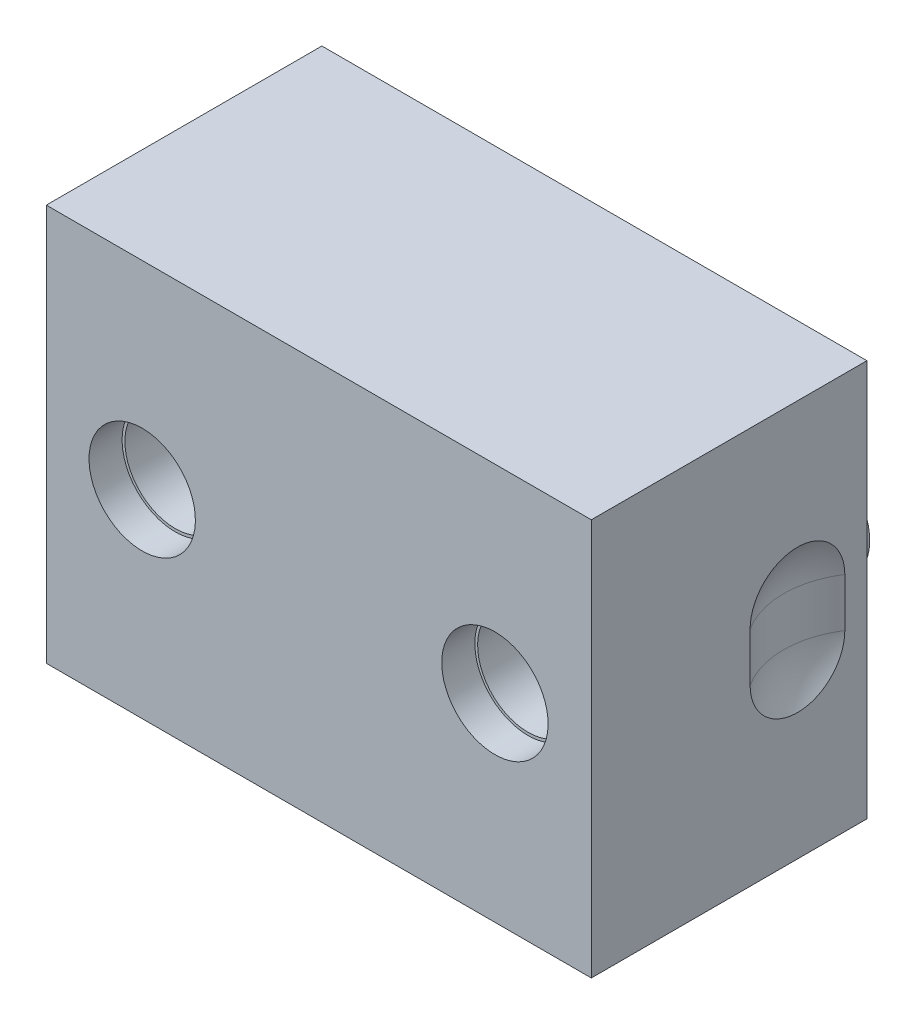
ISO-10303-21;
HEADER;
FILE_DESCRIPTION(('STEP AP214'),'2;1');
FILE_NAME('part.step','',(''),(''),'','','');
FILE_SCHEMA(('AUTOMOTIVE_DESIGN { 1 0 10303 214 1 1 1 1 }'));
ENDSEC;
DATA;
#1=APPLICATION_CONTEXT('core data for automotive mechanical design processes');
#2=APPLICATION_PROTOCOL_DEFINITION('international standard','automotive_design',2000,#1);
#3=PRODUCT_CONTEXT('',#1,'mechanical');
#4=PRODUCT('Part','Part','',(#3));
#5=PRODUCT_RELATED_PRODUCT_CATEGORY('part','',(#4));
#6=PRODUCT_DEFINITION_FORMATION('','',#4);
#7=PRODUCT_DEFINITION_CONTEXT('part definition',#1,'design');
#8=PRODUCT_DEFINITION('design','',#6,#7);
#9=PRODUCT_DEFINITION_SHAPE('','',#8);
#10=(LENGTH_UNIT() NAMED_UNIT(*) SI_UNIT(.MILLI.,.METRE.));
#11=(NAMED_UNIT(*) PLANE_ANGLE_UNIT() SI_UNIT($,.RADIAN.));
#12=(NAMED_UNIT(*) SI_UNIT($,.STERADIAN.) SOLID_ANGLE_UNIT());
#13=UNCERTAINTY_MEASURE_WITH_UNIT(LENGTH_MEASURE(1.E-05),#10,'distance_accuracy_value','');
#14=(GEOMETRIC_REPRESENTATION_CONTEXT(3) GLOBAL_UNCERTAINTY_ASSIGNED_CONTEXT((#13)) GLOBAL_UNIT_ASSIGNED_CONTEXT((#10,
#11,#12)) REPRESENTATION_CONTEXT('',''));
#15=CARTESIAN_POINT('',(0.,0.,0.));
#16=DIRECTION('',(0.,0.,1.));
#17=DIRECTION('',(1.,0.,0.));
#18=AXIS2_PLACEMENT_3D('',#15,#16,#17);
#19=CARTESIAN_POINT('',(31.9999999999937,6.98303303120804E-12,7.));
#20=DIRECTION('',(0.,0.,-1.));
#21=DIRECTION('',(0.,1.,0.));
#22=AXIS2_PLACEMENT_3D('',#19,#20,#21);
#23=CYLINDRICAL_SURFACE('',#22,2.6);
#24=CARTESIAN_POINT('',(31.9999999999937,6.98308201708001E-12,6.59999999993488));
#25=DIRECTION('',(0.,0.,1.));
#26=DIRECTION('',(0.,-1.,0.));
#27=AXIS2_PLACEMENT_3D('',#24,#25,#26);
#28=CIRCLE('',#27,2.59999999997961);
#29=CARTESIAN_POINT('',(31.9999999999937,-2.59999999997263,6.59999999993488));
#30=VERTEX_POINT('',#29);
#31=EDGE_CURVE('E142',#30,#30,#28,.T.);
#32=ORIENTED_EDGE('',*,*,#31,.T.);
#33=EDGE_LOOP('',(#32));
#34=FACE_BOUND('',#33,.T.);
#35=CARTESIAN_POINT('',(31.9999999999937,6.98389028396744E-12,0.));
#36=DIRECTION('',(0.,0.,-1.));
#37=DIRECTION('',(0.,1.,0.));
#38=AXIS2_PLACEMENT_3D('',#35,#36,#37);
#39=CIRCLE('',#38,2.6);
#40=CARTESIAN_POINT('',(31.9999999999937,2.60000000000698,0.));
#41=VERTEX_POINT('',#40);
#42=EDGE_CURVE('E18',#41,#41,#39,.F.);
#43=ORIENTED_EDGE('',*,*,#42,.F.);
#44=EDGE_LOOP('',(#43));
#45=FACE_BOUND('',#44,.T.);
#46=ADVANCED_FACE('F14',(#34,#45),#23,.F.);
#47=CARTESIAN_POINT('',(-6.21902529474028E-12,5.54116962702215E-12,7.));
#48=DIRECTION('',(0.,0.,-1.));
#49=DIRECTION('',(0.,1.,0.));
#50=AXIS2_PLACEMENT_3D('',#47,#48,#49);
#51=CYLINDRICAL_SURFACE('',#50,2.6);
#52=CARTESIAN_POINT('',(-6.21902529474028E-12,5.54121861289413E-12,6.59999999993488));
#53=DIRECTION('',(0.,0.,1.));
#54=DIRECTION('',(0.,-1.,0.));
#55=AXIS2_PLACEMENT_3D('',#52,#53,#54);
#56=CIRCLE('',#55,2.59999999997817);
#57=CARTESIAN_POINT('',(-6.21918449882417E-12,-2.59999999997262,6.59999999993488));
#58=VERTEX_POINT('',#57);
#59=EDGE_CURVE('E145',#58,#58,#56,.T.);
#60=ORIENTED_EDGE('',*,*,#59,.T.);
#61=EDGE_LOOP('',(#60));
#62=FACE_BOUND('',#61,.T.);
#63=CARTESIAN_POINT('',(-6.21902529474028E-12,5.54202687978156E-12,0.));
#64=DIRECTION('',(0.,0.,-1.));
#65=DIRECTION('',(0.,1.,0.));
#66=AXIS2_PLACEMENT_3D('',#63,#64,#65);
#67=CIRCLE('',#66,2.6);
#68=CARTESIAN_POINT('',(-6.21902529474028E-12,2.60000000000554,0.));
#69=VERTEX_POINT('',#68);
#70=EDGE_CURVE('E246',#69,#69,#67,.F.);
#71=ORIENTED_EDGE('',*,*,#70,.F.);
#72=EDGE_LOOP('',(#71));
#73=FACE_BOUND('',#72,.T.);
#74=ADVANCED_FACE('F256',(#62,#73),#51,.F.);
#75=CARTESIAN_POINT('',(-6.21902529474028E-12,5.54114046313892E-12,6.99999999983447));
#76=DIRECTION('',(0.,0.,1.));
#77=DIRECTION('',(0.,-1.,0.));
#78=AXIS2_PLACEMENT_3D('',#75,#76,#77);
#79=CONICAL_SURFACE('',#78,2.9999999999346,0.785398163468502);
#80=CARTESIAN_POINT('',(-6.21902529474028E-12,5.5411404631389E-12,6.99999999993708));
#81=DIRECTION('',(0.,0.,1.));
#82=DIRECTION('',(0.,-1.,0.));
#83=AXIS2_PLACEMENT_3D('',#80,#81,#82);
#84=CIRCLE('',#83,3.0000000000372);
#85=CARTESIAN_POINT('',(-6.21902529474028E-12,-3.00000000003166,6.99999999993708));
#86=VERTEX_POINT('',#85);
#87=EDGE_CURVE('E244',#86,#86,#84,.T.);
#88=ORIENTED_EDGE('',*,*,#87,.T.);
#89=EDGE_LOOP('',(#88));
#90=FACE_BOUND('',#89,.T.);
#91=ORIENTED_EDGE('',*,*,#59,.F.);
#92=EDGE_LOOP('',(#91));
#93=FACE_BOUND('',#92,.T.);
#94=ADVANCED_FACE('F263',(#90,#93),#79,.F.);
#95=CARTESIAN_POINT('',(31.9999999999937,6.98312935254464E-12,6.99999999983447));
#96=DIRECTION('',(0.,0.,1.));
#97=DIRECTION('',(0.,-1.,0.));
#98=AXIS2_PLACEMENT_3D('',#95,#96,#97);
#99=CONICAL_SURFACE('',#98,2.99999999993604,0.785398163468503);
#100=CARTESIAN_POINT('',(31.9999999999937,6.98312935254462E-12,6.99999999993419));
#101=DIRECTION('',(0.,0.,1.));
#102=DIRECTION('',(0.,-1.,0.));
#103=AXIS2_PLACEMENT_3D('',#100,#101,#102);
#104=CIRCLE('',#103,3.00000000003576);
#105=CARTESIAN_POINT('',(31.9999999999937,-3.00000000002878,6.99999999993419));
#106=VERTEX_POINT('',#105);
#107=EDGE_CURVE('E241',#106,#106,#104,.T.);
#108=ORIENTED_EDGE('',*,*,#107,.T.);
#109=EDGE_LOOP('',(#108));
#110=FACE_BOUND('',#109,.T.);
#111=ORIENTED_EDGE('',*,*,#31,.F.);
#112=EDGE_LOOP('',(#111));
#113=FACE_BOUND('',#112,.T.);
#114=ADVANCED_FACE('F269',(#110,#113),#99,.F.);
#115=CARTESIAN_POINT('',(29.4,0.,0.));
#116=DIRECTION('',(0.,0.,-1.));
#117=DIRECTION('',(0.,1.,0.));
#118=AXIS2_PLACEMENT_3D('',#115,#116,#117);
#119=PLANE('',#118);
#120=CARTESIAN_POINT('',(32.,0.,0.));
#121=DIRECTION('',(0.,0.,-1.));
#122=DIRECTION('',(0.,1.,0.));
#123=AXIS2_PLACEMENT_3D('',#120,#121,#122);
#124=CIRCLE('',#123,5.);
#125=CARTESIAN_POINT('',(32.,5.00000000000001,0.));
#126=VERTEX_POINT('',#125);
#127=EDGE_CURVE('E238',#126,#126,#124,.F.);
#128=ORIENTED_EDGE('',*,*,#127,.F.);
#129=EDGE_LOOP('',(#128));
#130=FACE_BOUND('',#129,.T.);
#131=ORIENTED_EDGE('',*,*,#42,.T.);
#132=EDGE_LOOP('',(#131));
#133=FACE_BOUND('',#132,.T.);
#134=ADVANCED_FACE('F253',(#130,#133),#119,.T.);
#135=CARTESIAN_POINT('',(-2.6,0.,0.));
#136=DIRECTION('',(0.,0.,-1.));
#137=DIRECTION('',(0.,1.,0.));
#138=AXIS2_PLACEMENT_3D('',#135,#136,#137);
#139=PLANE('',#138);
#140=CARTESIAN_POINT('',(0.,0.,0.));
#141=DIRECTION('',(0.,0.,-1.));
#142=DIRECTION('',(0.,1.,0.));
#143=AXIS2_PLACEMENT_3D('',#140,#141,#142);
#144=CIRCLE('',#143,5.);
#145=CARTESIAN_POINT('',(0.,5.00000000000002,0.));
#146=VERTEX_POINT('',#145);
#147=EDGE_CURVE('E235',#146,#146,#144,.F.);
#148=ORIENTED_EDGE('',*,*,#147,.F.);
#149=EDGE_LOOP('',(#148));
#150=FACE_BOUND('',#149,.T.);
#151=ORIENTED_EDGE('',*,*,#70,.T.);
#152=EDGE_LOOP('',(#151));
#153=FACE_BOUND('',#152,.T.);
#154=ADVANCED_FACE('F276',(#150,#153),#139,.T.);
#155=CARTESIAN_POINT('',(-3.33066907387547E-12,2.65352394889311E-12,7.));
#156=DIRECTION('',(0.,0.,-1.));
#157=DIRECTION('',(0.,1.,0.));
#158=AXIS2_PLACEMENT_3D('',#155,#156,#157);
#159=PLANE('',#158);
#160=CARTESIAN_POINT('',(-3.33066907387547E-12,2.65352394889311E-12,7.));
#161=DIRECTION('',(0.,0.,1.));
#162=DIRECTION('',(0.,-1.,0.));
#163=AXIS2_PLACEMENT_3D('',#160,#161,#162);
#164=CIRCLE('',#163,4.57);
#165=CARTESIAN_POINT('',(-3.33066907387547E-12,-4.56999999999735,7.));
#166=VERTEX_POINT('',#165);
#167=EDGE_CURVE('E232',#166,#166,#164,.T.);
#168=ORIENTED_EDGE('',*,*,#167,.T.);
#169=EDGE_LOOP('',(#168));
#170=FACE_BOUND('',#169,.T.);
#171=ORIENTED_EDGE('',*,*,#87,.F.);
#172=EDGE_LOOP('',(#171));
#173=FACE_BOUND('',#172,.T.);
#174=ADVANCED_FACE('F280',(#170,#173),#159,.F.);
#175=CARTESIAN_POINT('',(31.9999999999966,2.65156451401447E-12,7.));
#176=DIRECTION('',(0.,0.,-1.));
#177=DIRECTION('',(0.,1.,0.));
#178=AXIS2_PLACEMENT_3D('',#175,#176,#177);
#179=PLANE('',#178);
#180=CARTESIAN_POINT('',(31.9999999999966,2.65156451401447E-12,7.));
#181=DIRECTION('',(0.,0.,1.));
#182=DIRECTION('',(0.,-1.,0.));
#183=AXIS2_PLACEMENT_3D('',#180,#181,#182);
#184=CIRCLE('',#183,4.57);
#185=CARTESIAN_POINT('',(31.9999999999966,-4.56999999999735,7.));
#186=VERTEX_POINT('',#185);
#187=EDGE_CURVE('E81',#186,#186,#184,.T.);
#188=ORIENTED_EDGE('',*,*,#187,.T.);
#189=EDGE_LOOP('',(#188));
#190=FACE_BOUND('',#189,.T.);
#191=ORIENTED_EDGE('',*,*,#107,.F.);
#192=EDGE_LOOP('',(#191));
#193=FACE_BOUND('',#192,.T.);
#194=ADVANCED_FACE('F284',(#190,#193),#179,.F.);
#195=CARTESIAN_POINT('',(32.,0.,4.));
#196=DIRECTION('',(0.,0.,-1.));
#197=DIRECTION('',(0.,1.,0.));
#198=AXIS2_PLACEMENT_3D('',#195,#196,#197);
#199=CYLINDRICAL_SURFACE('',#198,5.);
#200=CARTESIAN_POINT('',(32.,0.,4.00000000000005));
#201=DIRECTION('',(0.,0.,-1.));
#202=DIRECTION('',(0.,1.,0.));
#203=AXIS2_PLACEMENT_3D('',#200,#201,#202);
#204=CIRCLE('',#203,5.);
#205=CARTESIAN_POINT('',(32.,5.00000000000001,4.00000000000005));
#206=VERTEX_POINT('',#205);
#207=EDGE_CURVE('E221',#206,#206,#204,.F.);
#208=ORIENTED_EDGE('',*,*,#207,.F.);
#209=EDGE_LOOP('',(#208));
#210=FACE_BOUND('',#209,.T.);
#211=ORIENTED_EDGE('',*,*,#127,.T.);
#212=EDGE_LOOP('',(#211));
#213=FACE_BOUND('',#212,.T.);
#214=ADVANCED_FACE('F288',(#210,#213),#199,.T.);
#215=CARTESIAN_POINT('',(0.,0.,4.));
#216=DIRECTION('',(0.,0.,-1.));
#217=DIRECTION('',(0.,1.,0.));
#218=AXIS2_PLACEMENT_3D('',#215,#216,#217);
#219=CYLINDRICAL_SURFACE('',#218,5.);
#220=CARTESIAN_POINT('',(0.,0.,4.00000000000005));
#221=DIRECTION('',(0.,0.,-1.));
#222=DIRECTION('',(0.,1.,0.));
#223=AXIS2_PLACEMENT_3D('',#220,#221,#222);
#224=CIRCLE('',#223,5.);
#225=CARTESIAN_POINT('',(0.,5.00000000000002,4.00000000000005));
#226=VERTEX_POINT('',#225);
#227=EDGE_CURVE('E211',#226,#226,#224,.F.);
#228=ORIENTED_EDGE('',*,*,#227,.F.);
#229=EDGE_LOOP('',(#228));
#230=FACE_BOUND('',#229,.T.);
#231=ORIENTED_EDGE('',*,*,#147,.T.);
#232=EDGE_LOOP('',(#231));
#233=FACE_BOUND('',#232,.T.);
#234=ADVANCED_FACE('F292',(#230,#233),#219,.T.);
#235=CARTESIAN_POINT('',(-3.33066907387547E-12,2.65156451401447E-12,23.));
#236=DIRECTION('',(0.,0.,1.));
#237=DIRECTION('',(0.,-1.,0.));
#238=AXIS2_PLACEMENT_3D('',#235,#236,#237);
#239=CYLINDRICAL_SURFACE('',#238,4.57);
#240=ORIENTED_EDGE('',*,*,#167,.F.);
#241=EDGE_LOOP('',(#240));
#242=FACE_BOUND('',#241,.T.);
#243=CARTESIAN_POINT('',(-3.33066907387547E-12,2.65119712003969E-12,25.9999994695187));
#244=DIRECTION('',(0.,0.,1.));
#245=DIRECTION('',(0.,-1.,0.));
#246=AXIS2_PLACEMENT_3D('',#243,#244,#245);
#247=CIRCLE('',#246,4.57);
#248=CARTESIAN_POINT('',(-3.33066907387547E-12,-4.56999999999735,25.9999994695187));
#249=VERTEX_POINT('',#248);
#250=EDGE_CURVE('E208',#249,#249,#247,.T.);
#251=ORIENTED_EDGE('',*,*,#250,.T.);
#252=EDGE_LOOP('',(#251));
#253=FACE_BOUND('',#252,.T.);
#254=ADVANCED_FACE('F296',(#242,#253),#239,.F.);
#255=CARTESIAN_POINT('',(31.9999999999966,2.64960507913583E-12,23.));
#256=DIRECTION('',(0.,0.,1.));
#257=DIRECTION('',(0.,-1.,0.));
#258=AXIS2_PLACEMENT_3D('',#255,#256,#257);
#259=CYLINDRICAL_SURFACE('',#258,4.57);
#260=ORIENTED_EDGE('',*,*,#187,.F.);
#261=EDGE_LOOP('',(#260));
#262=FACE_BOUND('',#261,.T.);
#263=CARTESIAN_POINT('',(31.9999999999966,2.64923768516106E-12,25.9999994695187));
#264=DIRECTION('',(0.,0.,1.));
#265=DIRECTION('',(0.,-1.,0.));
#266=AXIS2_PLACEMENT_3D('',#263,#264,#265);
#267=CIRCLE('',#266,4.57);
#268=CARTESIAN_POINT('',(31.9999999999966,-4.56999999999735,25.9999994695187));
#269=VERTEX_POINT('',#268);
#270=EDGE_CURVE('E96',#269,#269,#267,.T.);
#271=ORIENTED_EDGE('',*,*,#270,.T.);
#272=EDGE_LOOP('',(#271));
#273=FACE_BOUND('',#272,.T.);
#274=ADVANCED_FACE('F300',(#262,#273),#259,.F.);
#275=CARTESIAN_POINT('',(-15.33,-2.20429583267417,10.2999993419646));
#276=DIRECTION('',(0.423558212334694,0.712417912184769,0.559516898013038));
#277=DIRECTION('',(-0.905680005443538,0.320424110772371,0.277618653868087));
#278=AXIS2_PLACEMENT_3D('',#275,#276,#277);
#279=SPHERICAL_SURFACE('',#278,7.9);
#280=CARTESIAN_POINT('',(-15.33,-2.20429583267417,10.2999993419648));
#281=DIRECTION('',(0.,-1.,0.));
#282=DIRECTION('',(0.,0.,-1.));
#283=AXIS2_PLACEMENT_3D('',#280,#281,#282);
#284=CIRCLE('',#283,7.9);
#285=CARTESIAN_POINT('',(-8.7,-2.20429583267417,14.5957065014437));
#286=VERTEX_POINT('',#285);
#287=CARTESIAN_POINT('',(-8.7,-2.20429583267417,6.0042921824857));
#288=VERTEX_POINT('',#287);
#289=EDGE_CURVE('E73',#286,#288,#284,.F.);
#290=ORIENTED_EDGE('',*,*,#289,.T.);
#291=CARTESIAN_POINT('',(-8.7,-2.20429583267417,6.00429218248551));
#292=CARTESIAN_POINT('',(-8.7,-2.32511395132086,6.00427919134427));
#293=CARTESIAN_POINT('',(-8.7,-2.44593020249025,6.00938870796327));
#294=CARTESIAN_POINT('',(-8.7,-2.68669834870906,6.02975893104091));
#295=CARTESIAN_POINT('',(-8.7,-2.80665028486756,6.04501915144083));
#296=CARTESIAN_POINT('',(-8.7,-3.04475719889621,6.08558271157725));
#297=CARTESIAN_POINT('',(-8.7,-3.16291338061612,6.11087898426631));
#298=CARTESIAN_POINT('',(-8.7,-3.39667451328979,6.17133061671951));
#299=CARTESIAN_POINT('',(-8.7,-3.51227949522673,6.20648585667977));
#300=CARTESIAN_POINT('',(-8.7,-3.74015097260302,6.2864183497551));
#301=CARTESIAN_POINT('',(-8.7,-3.8524165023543,6.33119835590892));
#302=CARTESIAN_POINT('',(-8.7,-4.07281728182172,6.43007414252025));
#303=CARTESIAN_POINT('',(-8.7,-4.18095099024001,6.48417335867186));
#304=CARTESIAN_POINT('',(-8.7,-4.39221521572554,6.60125821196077));
#305=CARTESIAN_POINT('',(-8.7,-4.49534852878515,6.66423880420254));
#306=CARTESIAN_POINT('',(-8.7,-4.69598170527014,6.79868682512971));
#307=CARTESIAN_POINT('',(-8.7,-4.79347947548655,6.87015737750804));
#308=CARTESIAN_POINT('',(-8.7,-4.98207424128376,7.02103229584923));
#309=CARTESIAN_POINT('',(-8.69999999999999,-5.07317344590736,7.10043390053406));
#310=CARTESIAN_POINT('',(-8.70000000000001,-5.24839335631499,7.26665815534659));
#311=CARTESIAN_POINT('',(-8.70000000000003,-5.3325114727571,7.35348353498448));
#312=CARTESIAN_POINT('',(-8.69999999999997,-5.49311603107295,7.53389306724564));
#313=CARTESIAN_POINT('',(-8.69999999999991,-5.56960412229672,7.62747575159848));
#314=CARTESIAN_POINT('',(-8.70000000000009,-5.71445248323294,7.82078712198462));
#315=CARTESIAN_POINT('',(-8.70000000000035,-5.78280974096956,7.92051806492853));
#316=CARTESIAN_POINT('',(-8.70000000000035,-5.91085088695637,8.12534291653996));
#317=CARTESIAN_POINT('',(-8.70000000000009,-5.97053834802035,8.23043459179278));
#318=CARTESIAN_POINT('',(-8.69999999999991,-6.08086973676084,8.44531165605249));
#319=CARTESIAN_POINT('',(-8.7,-6.13151031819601,8.55509876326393));
#320=CARTESIAN_POINT('',(-8.7,-6.22334078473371,8.7785011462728));
#321=CARTESIAN_POINT('',(-8.69999999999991,-6.26453474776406,8.89211474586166));
#322=CARTESIAN_POINT('',(-8.70000000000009,-6.33722068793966,9.122450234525));
#323=CARTESIAN_POINT('',(-8.70000000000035,-6.36870908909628,9.2391732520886));
#324=CARTESIAN_POINT('',(-8.70000000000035,-6.42173046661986,9.47481749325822));
#325=CARTESIAN_POINT('',(-8.70000000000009,-6.4432667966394,9.59373796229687));
#326=CARTESIAN_POINT('',(-8.69999999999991,-6.47625238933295,9.83301192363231));
#327=CARTESIAN_POINT('',(-8.69999999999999,-6.48769814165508,9.95336589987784));
#328=CARTESIAN_POINT('',(-8.70000000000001,-6.50040744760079,10.1945920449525));
#329=CARTESIAN_POINT('',(-8.69999999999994,-6.50167253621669,10.3154641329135));
#330=CARTESIAN_POINT('',(-8.70000000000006,-6.49401556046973,10.5568852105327));
#331=CARTESIAN_POINT('',(-8.70000000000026,-6.48509349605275,10.6774342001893));
#332=CARTESIAN_POINT('',(-8.70000000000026,-6.45712333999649,10.9173717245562));
#333=CARTESIAN_POINT('',(-8.70000000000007,-6.43807358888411,11.036760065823));
#334=CARTESIAN_POINT('',(-8.69999999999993,-6.38999089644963,11.2734659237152));
#335=CARTESIAN_POINT('',(-8.69999999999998,-6.36096142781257,11.3907841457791));
#336=CARTESIAN_POINT('',(-8.70000000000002,-6.29311212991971,11.6225997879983));
#337=CARTESIAN_POINT('',(-8.7,-6.25428883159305,11.7370961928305));
#338=CARTESIAN_POINT('',(-8.69999999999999,-6.16714916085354,11.9623691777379));
#339=CARTESIAN_POINT('',(-8.7,-6.11883628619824,12.0731471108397));
#340=CARTESIAN_POINT('',(-8.7,-6.01303082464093,12.2902830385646));
#341=CARTESIAN_POINT('',(-8.7,-5.95553462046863,12.3966392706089));
#342=CARTESIAN_POINT('',(-8.7,-5.83180799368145,12.6040905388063));
#343=CARTESIAN_POINT('',(-8.7,-5.76558080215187,12.7051875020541));
#344=CARTESIAN_POINT('',(-8.7,-5.62482392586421,12.9014753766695));
#345=CARTESIAN_POINT('',(-8.7,-5.55029159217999,12.9966643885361));
#346=CARTESIAN_POINT('',(-8.7,-5.39350072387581,13.1803901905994));
#347=CARTESIAN_POINT('',(-8.7,-5.31124505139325,13.2689294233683));
#348=CARTESIAN_POINT('',(-8.7,-5.13954860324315,13.4387852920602));
#349=CARTESIAN_POINT('',(-8.7,-5.05010614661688,13.5201002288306));
#350=CARTESIAN_POINT('',(-8.7,-4.86472313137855,13.6748774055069));
#351=CARTESIAN_POINT('',(-8.7,-4.76878498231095,13.7483425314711));
#352=CARTESIAN_POINT('',(-8.7,-4.57099465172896,13.8869802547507));
#353=CARTESIAN_POINT('',(-8.7,-4.46913844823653,13.9521471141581));
#354=CARTESIAN_POINT('',(-8.7,-4.26033524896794,14.0736430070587));
#355=CARTESIAN_POINT('',(-8.7,-4.15339014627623,14.12997529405));
#356=CARTESIAN_POINT('',(-8.7,-3.93502758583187,14.2334813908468));
#357=CARTESIAN_POINT('',(-8.7,-3.8236058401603,14.2806461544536));
#358=CARTESIAN_POINT('',(-8.7,-3.59722389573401,14.3653963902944));
#359=CARTESIAN_POINT('',(-8.7,-3.48226504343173,14.4029854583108));
#360=CARTESIAN_POINT('',(-8.7,-3.24971945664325,14.468303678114));
#361=CARTESIAN_POINT('',(-8.7,-3.13213575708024,14.496043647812));
#362=CARTESIAN_POINT('',(-8.7,-2.89509682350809,14.5415140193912));
#363=CARTESIAN_POINT('',(-8.7,-2.77564253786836,14.5592493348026));
#364=CARTESIAN_POINT('',(-8.7,-2.58065620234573,14.5798529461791));
#365=CARTESIAN_POINT('',(-8.7,-2.50543627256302,14.5858018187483));
#366=CARTESIAN_POINT('',(-8.7,-2.35491211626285,14.5937257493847));
#367=CARTESIAN_POINT('',(-8.7,-2.27960823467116,14.5957073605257));
#368=CARTESIAN_POINT('',(-8.7,-2.20429583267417,14.5957065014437));
#369=B_SPLINE_CURVE_WITH_KNOTS('',3,(#291,#292,#293,#294,#295,#296,#297,#298,#299,#300,#301,
#302,#303,#304,#305,#306,#307,#308,#309,#310,#311,#312,#313,#314,#315,#316,#317,#318,#319,#320,
#321,#322,#323,#324,#325,#326,#327,#328,#329,#330,#331,#332,#333,#334,#335,#336,#337,#338,#339,
#340,#341,#342,#343,#344,#345,#346,#347,#348,#349,#350,#351,#352,#353,#354,#355,#356,#357,#358,
#359,#360,#361,#362,#363,#364,#365,#366,#367,#368),.UNSPECIFIED.,.F.,.F.,(4,2,2,2,2,2,2,2,2,2,2,
2,2,2,2,2,2,2,2,2,2,2,2,2,2,2,2,2,2,2,2,2,2,2,2,2,2,2,4),(0.,0.362343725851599,
0.724670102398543,1.08674179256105,1.44880908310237,1.81098007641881,2.17328487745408,
2.53538470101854,2.89761816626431,3.25972595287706,3.62196745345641,3.9841304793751,
4.34642724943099,4.70857429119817,5.07085500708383,5.43297903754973,5.79523633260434,
6.15737146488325,6.51963252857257,6.88183897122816,7.2440454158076,7.60631122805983,
7.96845110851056,8.33071944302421,8.6928544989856,9.05513255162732,9.41727691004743,
9.7795371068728,10.1416635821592,10.5038750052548,10.8659527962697,11.228279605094,
11.590472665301,11.9530213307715,12.3154336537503,12.6774466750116,13.039281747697,
13.2655500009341,13.4914441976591),.UNSPECIFIED.);
#370=EDGE_CURVE('E79',#288,#286,#369,.T.);
#371=ORIENTED_EDGE('',*,*,#370,.T.);
#372=EDGE_LOOP('',(#290,#371));
#373=FACE_BOUND('',#372,.T.);
#374=ADVANCED_FACE('F78',(#373),#279,.F.);
#375=CARTESIAN_POINT('',(-15.33,-26.004661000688,10.2999993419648));
#376=DIRECTION('',(0.,-1.,0.));
#377=DIRECTION('',(0.,0.,-1.));
#378=AXIS2_PLACEMENT_3D('',#375,#376,#377);
#379=CYLINDRICAL_SURFACE('',#378,7.9);
#380=DIRECTION('',(0.,1.,0.));
#381=VECTOR('',#380,1.);
#382=CARTESIAN_POINT('',(-8.7,1.00135803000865E-06,14.5957065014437));
#383=LINE('',#382,#381);
#384=CARTESIAN_POINT('',(-8.7,2.20428984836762,14.5957065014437));
#385=VERTEX_POINT('',#384);
#386=EDGE_CURVE('E89',#286,#385,#383,.T.);
#387=ORIENTED_EDGE('',*,*,#386,.T.);
#388=CARTESIAN_POINT('',(-15.33,2.20428984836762,10.2999993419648));
#389=DIRECTION('',(0.,-1.,0.));
#390=DIRECTION('',(0.,0.,-1.));
#391=AXIS2_PLACEMENT_3D('',#388,#389,#390);
#392=CIRCLE('',#391,7.9);
#393=CARTESIAN_POINT('',(-8.7,2.20428984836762,6.0042921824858));
#394=VERTEX_POINT('',#393);
#395=EDGE_CURVE('E80',#385,#394,#392,.F.);
#396=ORIENTED_EDGE('',*,*,#395,.T.);
#397=DIRECTION('',(0.,1.,0.));
#398=VECTOR('',#397,1.);
#399=CARTESIAN_POINT('',(-8.7,1.00135803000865E-06,6.00429218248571));
#400=LINE('',#399,#398);
#401=EDGE_CURVE('E87',#394,#288,#400,.F.);
#402=ORIENTED_EDGE('',*,*,#401,.T.);
#403=ORIENTED_EDGE('',*,*,#289,.F.);
#404=EDGE_LOOP('',(#387,#396,#402,#403));
#405=FACE_BOUND('',#404,.T.);
#406=ADVANCED_FACE('F91',(#405),#379,.F.);
#407=CARTESIAN_POINT('',(-15.33,2.20428984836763,10.2999993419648));
#408=DIRECTION('',(0.423558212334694,0.712417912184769,0.559516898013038));
#409=DIRECTION('',(-0.905680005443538,0.320424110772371,0.277618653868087));
#410=AXIS2_PLACEMENT_3D('',#407,#408,#409);
#411=SPHERICAL_SURFACE('',#410,7.9);
#412=ORIENTED_EDGE('',*,*,#395,.F.);
#413=CARTESIAN_POINT('',(-8.7,2.20428984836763,14.5957065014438));
#414=CARTESIAN_POINT('',(-8.7,2.32510796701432,14.5957194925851));
#415=CARTESIAN_POINT('',(-8.7,2.4459242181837,14.5906099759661));
#416=CARTESIAN_POINT('',(-8.7,2.68669236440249,14.5702397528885));
#417=CARTESIAN_POINT('',(-8.7,2.80664430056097,14.5549795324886));
#418=CARTESIAN_POINT('',(-8.7,3.04475121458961,14.5144159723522));
#419=CARTESIAN_POINT('',(-8.7,3.16290739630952,14.4891196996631));
#420=CARTESIAN_POINT('',(-8.7,3.39666852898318,14.4286680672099));
#421=CARTESIAN_POINT('',(-8.7,3.5122735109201,14.3935128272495));
#422=CARTESIAN_POINT('',(-8.7,3.7401449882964,14.3135803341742));
#423=CARTESIAN_POINT('',(-8.7,3.85241051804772,14.2688003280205));
#424=CARTESIAN_POINT('',(-8.7,4.07281129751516,14.1699245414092));
#425=CARTESIAN_POINT('',(-8.7,4.18094500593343,14.1158253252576));
#426=CARTESIAN_POINT('',(-8.7,4.39220923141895,13.9987404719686));
#427=CARTESIAN_POINT('',(-8.7,4.49534254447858,13.9357598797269));
#428=CARTESIAN_POINT('',(-8.7,4.69597572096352,13.8013118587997));
#429=CARTESIAN_POINT('',(-8.7,4.79347349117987,13.7298413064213));
#430=CARTESIAN_POINT('',(-8.7,4.9820682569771,13.5789663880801));
#431=CARTESIAN_POINT('',(-8.7,5.07316746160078,13.4995647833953));
#432=CARTESIAN_POINT('',(-8.7,5.24838737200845,13.3333405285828));
#433=CARTESIAN_POINT('',(-8.7,5.33250548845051,13.2465151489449));
#434=CARTESIAN_POINT('',(-8.7,5.49311004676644,13.0661056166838));
#435=CARTESIAN_POINT('',(-8.7,5.56959813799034,12.972522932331));
#436=CARTESIAN_POINT('',(-8.7,5.71444649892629,12.7792115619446));
#437=CARTESIAN_POINT('',(-8.7,5.78280375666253,12.6794806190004));
#438=CARTESIAN_POINT('',(-8.7,5.91084490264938,12.4746557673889));
#439=CARTESIAN_POINT('',(-8.7,5.97053236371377,12.3695640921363));
#440=CARTESIAN_POINT('',(-8.7,6.08086375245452,12.1546870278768));
#441=CARTESIAN_POINT('',(-8.7,6.13150433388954,12.0448999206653));
#442=CARTESIAN_POINT('',(-8.7,6.22333480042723,11.8214975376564));
#443=CARTESIAN_POINT('',(-8.7,6.26452876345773,11.7078839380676));
#444=CARTESIAN_POINT('',(-8.7,6.337214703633,11.4775484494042));
#445=CARTESIAN_POINT('',(-8.7,6.36870310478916,11.3608254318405));
#446=CARTESIAN_POINT('',(-8.7,6.42172448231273,11.1251811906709));
#447=CARTESIAN_POINT('',(-8.7,6.44326081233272,11.0062607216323));
#448=CARTESIAN_POINT('',(-8.7,6.47624640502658,10.766986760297));
#449=CARTESIAN_POINT('',(-8.7,6.48769215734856,10.6466327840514));
#450=CARTESIAN_POINT('',(-8.7,6.50040146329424,10.4054066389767));
#451=CARTESIAN_POINT('',(-8.7,6.50166655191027,10.2845345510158));
#452=CARTESIAN_POINT('',(-8.7,6.49400957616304,10.0431134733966));
#453=CARTESIAN_POINT('',(-8.7,6.48508751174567,9.92256448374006));
#454=CARTESIAN_POINT('',(-8.7,6.45711735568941,9.6826269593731));
#455=CARTESIAN_POINT('',(-8.7,6.43806760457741,9.56323861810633));
#456=CARTESIAN_POINT('',(-8.7,6.3899849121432,9.32653276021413));
#457=CARTESIAN_POINT('',(-8.7,6.36095544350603,9.20921453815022));
#458=CARTESIAN_POINT('',(-8.7,6.29310614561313,8.97739889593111));
#459=CARTESIAN_POINT('',(-8.7,6.25428284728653,8.86290249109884));
#460=CARTESIAN_POINT('',(-8.7,6.16714317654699,8.63762950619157));
#461=CARTESIAN_POINT('',(-8.7,6.1188303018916,8.52685157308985));
#462=CARTESIAN_POINT('',(-8.7,6.01302484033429,8.30971564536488));
#463=CARTESIAN_POINT('',(-8.7,5.95552863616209,8.20335941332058));
#464=CARTESIAN_POINT('',(-8.7,5.83180200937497,7.99590814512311));
#465=CARTESIAN_POINT('',(-8.7,5.76557481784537,7.89481118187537));
#466=CARTESIAN_POINT('',(-8.7,5.62481794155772,7.69852330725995));
#467=CARTESIAN_POINT('',(-8.7,5.55028560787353,7.6033342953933));
#468=CARTESIAN_POINT('',(-8.7,5.39349473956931,7.4196084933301));
#469=CARTESIAN_POINT('',(-8.7,5.31123906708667,7.33106926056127));
#470=CARTESIAN_POINT('',(-8.7,5.13954261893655,7.16121339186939));
#471=CARTESIAN_POINT('',(-8.7,5.05010016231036,7.07989845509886));
#472=CARTESIAN_POINT('',(-8.7,4.86471714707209,6.92512127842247));
#473=CARTESIAN_POINT('',(-8.7,4.76877899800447,6.85165615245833));
#474=CARTESIAN_POINT('',(-8.7,4.57098866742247,6.71301842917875));
#475=CARTESIAN_POINT('',(-8.7,4.46913246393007,6.64785156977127));
#476=CARTESIAN_POINT('',(-8.7,4.26032926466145,6.52635567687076));
#477=CARTESIAN_POINT('',(-8.7,4.15338416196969,6.4700233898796));
#478=CARTESIAN_POINT('',(-8.7,3.93502160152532,6.36651729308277));
#479=CARTESIAN_POINT('',(-8.7,3.8235998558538,6.31935252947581));
#480=CARTESIAN_POINT('',(-8.7,3.59721791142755,6.23460229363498));
#481=CARTESIAN_POINT('',(-8.7,3.48225905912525,6.19701322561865));
#482=CARTESIAN_POINT('',(-8.7,3.24971347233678,6.13169500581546));
#483=CARTESIAN_POINT('',(-8.7,3.13212977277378,6.10395503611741));
#484=CARTESIAN_POINT('',(-8.7,2.89509083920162,6.05848466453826));
#485=CARTESIAN_POINT('',(-8.7,2.77563655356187,6.04074934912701));
#486=CARTESIAN_POINT('',(-8.7,2.58065021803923,6.02014573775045));
#487=CARTESIAN_POINT('',(-8.7,2.50543028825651,6.01419686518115));
#488=CARTESIAN_POINT('',(-8.7,2.35490613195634,6.00627293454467));
#489=CARTESIAN_POINT('',(-8.7,2.27960225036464,6.00429132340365));
#490=CARTESIAN_POINT('',(-8.7,2.20428984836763,6.00429218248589));
#491=B_SPLINE_CURVE_WITH_KNOTS('',3,(#413,#414,#415,#416,#417,#418,#419,#420,#421,#422,#423,
#424,#425,#426,#427,#428,#429,#430,#431,#432,#433,#434,#435,#436,#437,#438,#439,#440,#441,#442,
#443,#444,#445,#446,#447,#448,#449,#450,#451,#452,#453,#454,#455,#456,#457,#458,#459,#460,#461,
#462,#463,#464,#465,#466,#467,#468,#469,#470,#471,#472,#473,#474,#475,#476,#477,#478,#479,#480,
#481,#482,#483,#484,#485,#486,#487,#488,#489,#490),.UNSPECIFIED.,.F.,.F.,(4,2,2,2,2,2,2,2,2,2,2,
2,2,2,2,2,2,2,2,2,2,2,2,2,2,2,2,2,2,2,2,2,2,2,2,2,2,2,4),(0.,0.362343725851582,
0.724670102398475,1.08674179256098,1.44880908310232,1.81098007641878,2.17328487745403,
2.53538470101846,2.89761816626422,3.25972595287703,3.62196745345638,3.98413047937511,
4.3464272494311,4.70857429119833,5.07085500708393,5.43297903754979,5.7952363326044,
6.15737146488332,6.51963252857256,6.88183897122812,7.24404541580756,7.60631122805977,
7.96845110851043,8.330719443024,8.69285449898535,9.05513255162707,9.41727691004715,
9.77953710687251,10.141663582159,10.5038750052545,10.8659527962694,11.2282796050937,
11.5904726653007,11.9530213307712,12.31543365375,12.6774466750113,13.0392817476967,
13.2655500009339,13.4914441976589),.UNSPECIFIED.);
#492=EDGE_CURVE('E108',#385,#394,#491,.T.);
#493=ORIENTED_EDGE('',*,*,#492,.T.);
#494=EDGE_LOOP('',(#412,#493));
#495=FACE_BOUND('',#494,.T.);
#496=ADVANCED_FACE('F314',(#495),#411,.F.);
#497=CARTESIAN_POINT('',(47.3750996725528,2.20429284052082,10.3));
#498=DIRECTION('',(0.423558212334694,0.712417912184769,0.559516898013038));
#499=DIRECTION('',(-0.905680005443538,0.320424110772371,0.277618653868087));
#500=AXIS2_PLACEMENT_3D('',#497,#498,#499);
#501=SPHERICAL_SURFACE('',#500,7.9);
#502=CARTESIAN_POINT('',(47.3750996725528,2.20429284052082,10.3));
#503=DIRECTION('',(0.,1.,0.));
#504=DIRECTION('',(0.,0.,1.));
#505=AXIS2_PLACEMENT_3D('',#502,#503,#504);
#506=CIRCLE('',#505,7.9);
#507=CARTESIAN_POINT('',(40.7450996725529,2.20429284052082,14.5957071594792));
#508=VERTEX_POINT('',#507);
#509=CARTESIAN_POINT('',(40.7450996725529,2.20429284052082,6.00429284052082));
#510=VERTEX_POINT('',#509);
#511=EDGE_CURVE('E227',#508,#510,#506,.F.);
#512=ORIENTED_EDGE('',*,*,#511,.T.);
#513=CARTESIAN_POINT('',(40.7450996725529,2.20429284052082,6.00429284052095));
#514=CARTESIAN_POINT('',(40.7450996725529,2.32511095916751,6.00427984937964));
#515=CARTESIAN_POINT('',(40.7450996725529,2.4459272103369,6.00938936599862));
#516=CARTESIAN_POINT('',(40.7450996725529,2.68669535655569,6.02975958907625));
#517=CARTESIAN_POINT('',(40.7450996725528,2.80664729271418,6.04501980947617));
#518=CARTESIAN_POINT('',(40.7450996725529,3.04475420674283,6.08558336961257));
#519=CARTESIAN_POINT('',(40.7450996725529,3.16291038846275,6.11087964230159));
#520=CARTESIAN_POINT('',(40.7450996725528,3.39667152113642,6.17133127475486));
#521=CARTESIAN_POINT('',(40.7450996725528,3.51227650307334,6.2064865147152));
#522=CARTESIAN_POINT('',(40.7450996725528,3.74014798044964,6.28641900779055));
#523=CARTESIAN_POINT('',(40.7450996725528,3.85241351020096,6.33119901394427));
#524=CARTESIAN_POINT('',(40.7450996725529,4.07281428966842,6.43007480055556));
#525=CARTESIAN_POINT('',(40.7450996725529,4.18094799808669,6.4841740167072));
#526=CARTESIAN_POINT('',(40.7450996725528,4.39221222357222,6.60125886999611));
#527=CARTESIAN_POINT('',(40.7450996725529,4.49534553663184,6.66423946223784));
#528=CARTESIAN_POINT('',(40.7450996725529,4.69597871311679,6.79868748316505));
#529=CARTESIAN_POINT('',(40.7450996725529,4.79347648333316,6.87015803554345));
#530=CARTESIAN_POINT('',(40.7450996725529,4.98207124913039,7.02103295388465));
#531=CARTESIAN_POINT('',(40.7450996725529,5.07317045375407,7.10043455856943));
#532=CARTESIAN_POINT('',(40.7450996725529,5.24839036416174,7.26665881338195));
#533=CARTESIAN_POINT('',(40.7450996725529,5.33250848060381,7.35348419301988));
#534=CARTESIAN_POINT('',(40.7450996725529,5.49311303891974,7.53389372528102));
#535=CARTESIAN_POINT('',(40.7450996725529,5.56960113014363,7.6274764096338));
#536=CARTESIAN_POINT('',(40.7450996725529,5.71444949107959,7.82078778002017));
#537=CARTESIAN_POINT('',(40.7450996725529,5.78280674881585,7.92051872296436));
#538=CARTESIAN_POINT('',(40.7450996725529,5.91084789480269,8.12534357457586));
#539=CARTESIAN_POINT('',(40.7450996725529,5.97053535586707,8.23043524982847));
#540=CARTESIAN_POINT('',(40.7450996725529,6.08086674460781,8.44531231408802));
#541=CARTESIAN_POINT('',(40.7450996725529,6.13150732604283,8.55509942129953));
#542=CARTESIAN_POINT('',(40.7450996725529,6.22333779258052,8.77850180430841));
#543=CARTESIAN_POINT('',(40.7450996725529,6.26453175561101,8.89211540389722));
#544=CARTESIAN_POINT('',(40.7450996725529,6.33721769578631,9.12245089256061));
#545=CARTESIAN_POINT('',(40.7450996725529,6.3687060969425,9.23917391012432));
#546=CARTESIAN_POINT('',(40.7450996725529,6.42172747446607,9.47481815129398));
#547=CARTESIAN_POINT('',(40.7450996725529,6.44326380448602,9.59373862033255));
#548=CARTESIAN_POINT('',(40.7450996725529,6.47624939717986,9.83301258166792));
#549=CARTESIAN_POINT('',(40.7450996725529,6.48769514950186,9.95336655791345));
#550=CARTESIAN_POINT('',(40.7450996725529,6.50040445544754,10.1945927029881));
#551=CARTESIAN_POINT('',(40.7450996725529,6.50166954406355,10.3154647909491));
#552=CARTESIAN_POINT('',(40.7450996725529,6.49401256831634,10.5568858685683));
#553=CARTESIAN_POINT('',(40.7450996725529,6.48509050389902,10.6774348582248));
#554=CARTESIAN_POINT('',(40.7450996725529,6.45712034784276,10.9173723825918));
#555=CARTESIAN_POINT('',(40.7450996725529,6.4380705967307,11.0367607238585));
#556=CARTESIAN_POINT('',(40.7450996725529,6.38998790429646,11.2734665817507));
#557=CARTESIAN_POINT('',(40.7450996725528,6.36095843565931,11.3907848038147));
#558=CARTESIAN_POINT('',(40.7450996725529,6.2931091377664,11.6226004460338));
#559=CARTESIAN_POINT('',(40.7450996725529,6.25428583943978,11.737096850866));
#560=CARTESIAN_POINT('',(40.7450996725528,6.16714616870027,11.9623698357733));
#561=CARTESIAN_POINT('',(40.7450996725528,6.11883329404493,12.0731477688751));
#562=CARTESIAN_POINT('',(40.7450996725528,6.01302783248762,12.2902836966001));
#563=CARTESIAN_POINT('',(40.7450996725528,5.95553162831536,12.3966399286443));
#564=CARTESIAN_POINT('',(40.7450996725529,5.83180500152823,12.6040911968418));
#565=CARTESIAN_POINT('',(40.7450996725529,5.76557780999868,12.7051881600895));
#566=CARTESIAN_POINT('',(40.7450996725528,5.62482093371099,12.9014760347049));
#567=CARTESIAN_POINT('',(40.7450996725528,5.5502886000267,12.9966650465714));
#568=CARTESIAN_POINT('',(40.7450996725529,5.39349773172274,13.1803908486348));
#569=CARTESIAN_POINT('',(40.7450996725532,5.31124205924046,13.268930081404));
#570=CARTESIAN_POINT('',(40.7450996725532,5.1395456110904,13.4387859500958));
#571=CARTESIAN_POINT('',(40.7450996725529,5.0501031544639,13.520100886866));
#572=CARTESIAN_POINT('',(40.7450996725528,4.86472013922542,13.6748780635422));
#573=CARTESIAN_POINT('',(40.7450996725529,4.7687819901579,13.7483431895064));
#574=CARTESIAN_POINT('',(40.7450996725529,4.57099165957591,13.886980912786));
#575=CARTESIAN_POINT('',(40.7450996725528,4.46913545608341,13.9521477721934));
#576=CARTESIAN_POINT('',(40.7450996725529,4.26033225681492,14.0736436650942));
#577=CARTESIAN_POINT('',(40.7450996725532,4.15338715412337,14.1299759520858));
#578=CARTESIAN_POINT('',(40.7450996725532,3.93502459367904,14.2334820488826));
#579=CARTESIAN_POINT('',(40.7450996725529,3.82360284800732,14.2806468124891));
#580=CARTESIAN_POINT('',(40.7450996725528,3.59722090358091,14.3653970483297));
#581=CARTESIAN_POINT('',(40.7450996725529,3.48226205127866,14.4029861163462));
#582=CARTESIAN_POINT('',(40.7450996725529,3.24971646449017,14.4683043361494));
#583=CARTESIAN_POINT('',(40.7450996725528,3.13213276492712,14.4960443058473));
#584=CARTESIAN_POINT('',(40.7450996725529,2.89509383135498,14.5415146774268));
#585=CARTESIAN_POINT('',(40.7450996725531,2.7756395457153,14.5592499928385));
#586=CARTESIAN_POINT('',(40.7450996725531,2.58065321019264,14.5798536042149));
#587=CARTESIAN_POINT('',(40.7450996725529,2.50543328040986,14.5858024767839));
#588=CARTESIAN_POINT('',(40.7450996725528,2.35490912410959,14.5937264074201));
#589=CARTESIAN_POINT('',(40.7450996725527,2.27960524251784,14.595708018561));
#590=CARTESIAN_POINT('',(40.7450996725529,2.20429284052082,14.5957071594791));
#591=B_SPLINE_CURVE_WITH_KNOTS('',3,(#513,#514,#515,#516,#517,#518,#519,#520,#521,#522,#523,
#524,#525,#526,#527,#528,#529,#530,#531,#532,#533,#534,#535,#536,#537,#538,#539,#540,#541,#542,
#543,#544,#545,#546,#547,#548,#549,#550,#551,#552,#553,#554,#555,#556,#557,#558,#559,#560,#561,
#562,#563,#564,#565,#566,#567,#568,#569,#570,#571,#572,#573,#574,#575,#576,#577,#578,#579,#580,
#581,#582,#583,#584,#585,#586,#587,#588,#589,#590),.UNSPECIFIED.,.F.,.F.,(4,2,2,2,2,2,2,2,2,2,2,
2,2,2,2,2,2,2,2,2,2,2,2,2,2,2,2,2,2,2,2,2,2,2,2,2,2,2,4),(0.,0.362343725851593,
0.724670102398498,1.08674179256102,1.44880908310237,1.81098007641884,2.1732848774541,
2.53538470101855,2.89761816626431,3.25972595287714,3.62196745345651,3.98413047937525,
4.34642724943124,4.70857429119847,5.07085500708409,5.43297903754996,5.79523633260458,
6.15737146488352,6.51963252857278,6.88183897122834,7.24404541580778,7.60631122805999,
7.96845110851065,8.33071944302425,8.69285449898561,9.05513255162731,9.41727691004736,
9.77953710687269,10.1416635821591,10.5038750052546,10.8659527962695,11.2282796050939,
11.5904726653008,11.9530213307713,12.3154336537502,12.6774466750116,13.039281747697,
13.2655500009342,13.4914441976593),.UNSPECIFIED.);
#592=EDGE_CURVE('E113',#510,#508,#591,.T.);
#593=ORIENTED_EDGE('',*,*,#592,.T.);
#594=EDGE_LOOP('',(#512,#593));
#595=FACE_BOUND('',#594,.T.);
#596=ADVANCED_FACE('F317',(#595),#501,.F.);
#597=CARTESIAN_POINT('',(47.3750996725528,-26.0046580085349,10.3));
#598=DIRECTION('',(0.,1.,0.));
#599=DIRECTION('',(0.,0.,1.));
#600=AXIS2_PLACEMENT_3D('',#597,#598,#599);
#601=CYLINDRICAL_SURFACE('',#600,7.9);
#602=DIRECTION('',(0.,-1.,0.));
#603=VECTOR('',#602,1.);
#604=CARTESIAN_POINT('',(40.7450996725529,0.,6.00429284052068));
#605=LINE('',#604,#603);
#606=CARTESIAN_POINT('',(40.7450996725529,-2.20429284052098,6.00429284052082));
#607=VERTEX_POINT('',#606);
#608=EDGE_CURVE('E114',#607,#510,#605,.F.);
#609=ORIENTED_EDGE('',*,*,#608,.T.);
#610=ORIENTED_EDGE('',*,*,#511,.F.);
#611=DIRECTION('',(0.,-1.,0.));
#612=VECTOR('',#611,1.);
#613=CARTESIAN_POINT('',(40.7450996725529,0.,14.5957071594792));
#614=LINE('',#613,#612);
#615=CARTESIAN_POINT('',(40.7450996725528,-2.20429284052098,14.5957071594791));
#616=VERTEX_POINT('',#615);
#617=EDGE_CURVE('E109',#508,#616,#614,.T.);
#618=ORIENTED_EDGE('',*,*,#617,.T.);
#619=CARTESIAN_POINT('',(47.3750996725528,-2.20429284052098,10.3));
#620=DIRECTION('',(0.,1.,0.));
#621=DIRECTION('',(0.,0.,1.));
#622=AXIS2_PLACEMENT_3D('',#619,#620,#621);
#623=CIRCLE('',#622,7.9);
#624=EDGE_CURVE('E224',#616,#607,#623,.F.);
#625=ORIENTED_EDGE('',*,*,#624,.T.);
#626=EDGE_LOOP('',(#609,#610,#618,#625));
#627=FACE_BOUND('',#626,.T.);
#628=ADVANCED_FACE('F337',(#627),#601,.F.);
#629=CARTESIAN_POINT('',(47.3750996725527,-2.20429284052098,10.2999999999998));
#630=DIRECTION('',(0.423558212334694,0.712417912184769,0.559516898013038));
#631=DIRECTION('',(-0.905680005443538,0.320424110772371,0.277618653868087));
#632=AXIS2_PLACEMENT_3D('',#629,#630,#631);
#633=SPHERICAL_SURFACE('',#632,7.9);
#634=ORIENTED_EDGE('',*,*,#624,.F.);
#635=CARTESIAN_POINT('',(40.7450996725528,-2.20429284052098,14.595707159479));
#636=CARTESIAN_POINT('',(40.7450996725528,-2.32511095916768,14.5957201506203));
#637=CARTESIAN_POINT('',(40.7450996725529,-2.44592721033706,14.5906106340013));
#638=CARTESIAN_POINT('',(40.7450996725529,-2.68669535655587,14.5702404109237));
#639=CARTESIAN_POINT('',(40.7450996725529,-2.80664729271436,14.5549801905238));
#640=CARTESIAN_POINT('',(40.7450996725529,-3.04475420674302,14.5144166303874));
#641=CARTESIAN_POINT('',(40.7450996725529,-3.16291038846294,14.4891203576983));
#642=CARTESIAN_POINT('',(40.7450996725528,-3.39667152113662,14.4286687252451));
#643=CARTESIAN_POINT('',(40.7450996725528,-3.51227650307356,14.3935134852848));
#644=CARTESIAN_POINT('',(40.7450996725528,-3.74014798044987,14.3135809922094));
#645=CARTESIAN_POINT('',(40.7450996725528,-3.85241351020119,14.2688009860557));
#646=CARTESIAN_POINT('',(40.7450996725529,-4.07281428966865,14.1699251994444));
#647=CARTESIAN_POINT('',(40.7450996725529,-4.18094799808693,14.1158259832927));
#648=CARTESIAN_POINT('',(40.7450996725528,-4.39221222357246,13.9987411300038));
#649=CARTESIAN_POINT('',(40.7450996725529,-4.49534553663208,13.9357605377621));
#650=CARTESIAN_POINT('',(40.7450996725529,-4.69597871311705,13.8013125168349));
#651=CARTESIAN_POINT('',(40.7450996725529,-4.79347648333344,13.7298419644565));
#652=CARTESIAN_POINT('',(40.7450996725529,-4.98207124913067,13.5789670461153));
#653=CARTESIAN_POINT('',(40.7450996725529,-5.07317045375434,13.4995654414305));
#654=CARTESIAN_POINT('',(40.7450996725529,-5.24839036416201,13.3333411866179));
#655=CARTESIAN_POINT('',(40.7450996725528,-5.33250848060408,13.24651580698));
#656=CARTESIAN_POINT('',(40.7450996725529,-5.49311303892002,13.0661062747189));
#657=CARTESIAN_POINT('',(40.7450996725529,-5.5696011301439,12.9725235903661));
#658=CARTESIAN_POINT('',(40.7450996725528,-5.71444949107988,12.7792122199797));
#659=CARTESIAN_POINT('',(40.7450996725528,-5.78280674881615,12.6794812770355));
#660=CARTESIAN_POINT('',(40.7450996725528,-5.910847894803,12.474656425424));
#661=CARTESIAN_POINT('',(40.7450996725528,-5.97053535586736,12.3695647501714));
#662=CARTESIAN_POINT('',(40.7450996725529,-6.08086674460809,12.1546876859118));
#663=CARTESIAN_POINT('',(40.7450996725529,-6.13150732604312,12.0449005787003));
#664=CARTESIAN_POINT('',(40.7450996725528,-6.22333779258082,11.8214981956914));
#665=CARTESIAN_POINT('',(40.7450996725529,-6.26453175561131,11.7078845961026));
#666=CARTESIAN_POINT('',(40.7450996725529,-6.33721769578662,11.4775491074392));
#667=CARTESIAN_POINT('',(40.7450996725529,-6.36870609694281,11.3608260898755));
#668=CARTESIAN_POINT('',(40.7450996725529,-6.42172747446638,11.1251818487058));
#669=CARTESIAN_POINT('',(40.7450996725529,-6.44326380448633,11.0062613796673));
#670=CARTESIAN_POINT('',(40.7450996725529,-6.47624939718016,10.7669874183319));
#671=CARTESIAN_POINT('',(40.7450996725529,-6.48769514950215,10.6466334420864));
#672=CARTESIAN_POINT('',(40.7450996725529,-6.50040445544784,10.4054072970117));
#673=CARTESIAN_POINT('',(40.7450996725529,-6.50166954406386,10.2845352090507));
#674=CARTESIAN_POINT('',(40.7450996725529,-6.49401256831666,10.0431141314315));
#675=CARTESIAN_POINT('',(40.7450996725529,-6.48509050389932,9.92256514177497));
#676=CARTESIAN_POINT('',(40.7450996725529,-6.45712034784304,9.682627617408));
#677=CARTESIAN_POINT('',(40.7450996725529,-6.438070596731,9.56323927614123));
#678=CARTESIAN_POINT('',(40.7450996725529,-6.38998790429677,9.32653341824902));
#679=CARTESIAN_POINT('',(40.7450996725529,-6.36095843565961,9.2092151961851));
#680=CARTESIAN_POINT('',(40.7450996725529,-6.29310913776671,8.97739955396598));
#681=CARTESIAN_POINT('',(40.7450996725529,-6.25428583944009,8.86290314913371));
#682=CARTESIAN_POINT('',(40.7450996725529,-6.16714616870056,8.63763016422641));
#683=CARTESIAN_POINT('',(40.7450996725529,-6.1188332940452,8.52685223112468));
#684=CARTESIAN_POINT('',(40.7450996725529,-6.01302783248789,8.30971630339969));
#685=CARTESIAN_POINT('',(40.7450996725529,-5.95553162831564,8.20336007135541));
#686=CARTESIAN_POINT('',(40.7450996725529,-5.83180500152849,7.99590880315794));
#687=CARTESIAN_POINT('',(40.7450996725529,-5.7655778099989,7.89481183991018));
#688=CARTESIAN_POINT('',(40.7450996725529,-5.62482093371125,7.69852396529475));
#689=CARTESIAN_POINT('',(40.7450996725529,-5.55028860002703,7.60333495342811));
#690=CARTESIAN_POINT('',(40.7450996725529,-5.39349773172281,7.41960915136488));
#691=CARTESIAN_POINT('',(40.7450996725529,-5.3112420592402,7.33106991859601));
#692=CARTESIAN_POINT('',(40.7450996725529,-5.13954561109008,7.16121404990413));
#693=CARTESIAN_POINT('',(40.7450996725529,-5.05010315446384,7.07989911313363));
#694=CARTESIAN_POINT('',(40.7450996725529,-4.86472013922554,6.92512193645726));
#695=CARTESIAN_POINT('',(40.7450996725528,-4.76878199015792,6.8516568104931));
#696=CARTESIAN_POINT('',(40.7450996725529,-4.57099165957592,6.7130190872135));
#697=CARTESIAN_POINT('',(40.7450996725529,-4.4691354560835,6.64785222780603));
#698=CARTESIAN_POINT('',(40.7450996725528,-4.26033225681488,6.5263563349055));
#699=CARTESIAN_POINT('',(40.7450996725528,-4.15338715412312,6.4700240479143));
#700=CARTESIAN_POINT('',(40.7450996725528,-3.93502459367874,6.36651795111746));
#701=CARTESIAN_POINT('',(40.7450996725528,-3.8236028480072,6.31935318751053));
#702=CARTESIAN_POINT('',(40.7450996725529,-3.59722090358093,6.23460295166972));
#703=CARTESIAN_POINT('',(40.7450996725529,-3.48226205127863,6.19701388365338));
#704=CARTESIAN_POINT('',(40.7450996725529,-3.24971646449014,6.13169566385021));
#705=CARTESIAN_POINT('',(40.7450996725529,-3.13213276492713,6.10395569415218));
#706=CARTESIAN_POINT('',(40.7450996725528,-2.89509383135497,6.05848532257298));
#707=CARTESIAN_POINT('',(40.7450996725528,-2.77563954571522,6.04075000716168));
#708=CARTESIAN_POINT('',(40.7450996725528,-2.58065321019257,6.02014639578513));
#709=CARTESIAN_POINT('',(40.7450996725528,-2.50543328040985,6.01419752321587));
#710=CARTESIAN_POINT('',(40.7450996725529,-2.35490912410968,6.00627359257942));
#711=CARTESIAN_POINT('',(40.7450996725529,-2.27960524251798,6.00429198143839));
#712=CARTESIAN_POINT('',(40.7450996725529,-2.20429284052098,6.00429284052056));
#713=B_SPLINE_CURVE_WITH_KNOTS('',3,(#635,#636,#637,#638,#639,#640,#641,#642,#643,#644,#645,
#646,#647,#648,#649,#650,#651,#652,#653,#654,#655,#656,#657,#658,#659,#660,#661,#662,#663,#664,
#665,#666,#667,#668,#669,#670,#671,#672,#673,#674,#675,#676,#677,#678,#679,#680,#681,#682,#683,
#684,#685,#686,#687,#688,#689,#690,#691,#692,#693,#694,#695,#696,#697,#698,#699,#700,#701,#702,
#703,#704,#705,#706,#707,#708,#709,#710,#711,#712),.UNSPECIFIED.,.F.,.F.,(4,2,2,2,2,2,2,2,2,2,2,
2,2,2,2,2,2,2,2,2,2,2,2,2,2,2,2,2,2,2,2,2,2,2,2,2,2,2,4),(0.,0.362343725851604,
0.724670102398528,1.08674179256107,1.44880908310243,1.81098007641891,2.17328487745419,
2.53538470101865,2.89761816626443,3.25972595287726,3.62196745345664,3.98413047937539,
4.34642724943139,4.70857429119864,5.07085500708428,5.43297903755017,5.7952363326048,
6.15737146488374,6.519632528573,6.88183897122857,7.24404541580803,7.60631122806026,
7.96845110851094,8.33071944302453,8.69285449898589,9.05513255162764,9.41727691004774,
9.77953710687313,10.1416635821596,10.5038750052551,10.8659527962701,11.2282796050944,
11.5904726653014,11.9530213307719,12.3154336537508,12.6774466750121,13.0392817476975,
13.2655500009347,13.4914441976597),.UNSPECIFIED.);
#714=EDGE_CURVE('E112',#616,#607,#713,.T.);
#715=ORIENTED_EDGE('',*,*,#714,.T.);
#716=EDGE_LOOP('',(#634,#715));
#717=FACE_BOUND('',#716,.T.);
#718=ADVANCED_FACE('F168',(#717),#633,.F.);
#719=CARTESIAN_POINT('',(16.,0.,4.00000000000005));
#720=DIRECTION('',(0.,0.,-1.));
#721=DIRECTION('',(0.,1.,0.));
#722=AXIS2_PLACEMENT_3D('',#719,#720,#721);
#723=PLANE('',#722);
#724=DIRECTION('',(1.,0.,0.));
#725=VECTOR('',#724,1.);
#726=CARTESIAN_POINT('',(16.,-18.,4.00000000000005));
#727=LINE('',#726,#725);
#728=CARTESIAN_POINT('',(40.7450996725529,-18.,4.00000000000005));
#729=VERTEX_POINT('',#728);
#730=CARTESIAN_POINT('',(-8.7,-17.999999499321,4.00000000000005));
#731=VERTEX_POINT('',#730);
#732=EDGE_CURVE('E122',#729,#731,#727,.F.);
#733=ORIENTED_EDGE('',*,*,#732,.T.);
#734=DIRECTION('',(0.,1.,0.));
#735=VECTOR('',#734,1.);
#736=CARTESIAN_POINT('',(-8.7,1.00135803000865E-06,4.00000000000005));
#737=LINE('',#736,#735);
#738=CARTESIAN_POINT('',(-8.7,18.0000007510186,4.00000000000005));
#739=VERTEX_POINT('',#738);
#740=EDGE_CURVE('E93',#731,#739,#737,.T.);
#741=ORIENTED_EDGE('',*,*,#740,.T.);
#742=DIRECTION('',(1.,0.,0.));
#743=VECTOR('',#742,1.);
#744=CARTESIAN_POINT('',(16.,18.,4.00000000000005));
#745=LINE('',#744,#743);
#746=CARTESIAN_POINT('',(40.7450996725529,18.0000002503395,4.00000000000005));
#747=VERTEX_POINT('',#746);
#748=EDGE_CURVE('E101',#739,#747,#745,.T.);
#749=ORIENTED_EDGE('',*,*,#748,.T.);
#750=DIRECTION('',(0.,-1.,0.));
#751=VECTOR('',#750,1.);
#752=CARTESIAN_POINT('',(40.7450996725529,0.,4.00000000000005));
#753=LINE('',#752,#751);
#754=EDGE_CURVE('E117',#747,#729,#753,.T.);
#755=ORIENTED_EDGE('',*,*,#754,.T.);
#756=EDGE_LOOP('',(#733,#741,#749,#755));
#757=FACE_BOUND('',#756,.T.);
#758=ORIENTED_EDGE('',*,*,#227,.T.);
#759=EDGE_LOOP('',(#758));
#760=FACE_BOUND('',#759,.T.);
#761=ORIENTED_EDGE('',*,*,#207,.T.);
#762=EDGE_LOOP('',(#761));
#763=FACE_BOUND('',#762,.T.);
#764=ADVANCED_FACE('F329',(#757,#760,#763),#723,.T.);
#765=CARTESIAN_POINT('',(-3.33066907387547E-12,2.65119712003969E-12,25.9999994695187));
#766=DIRECTION('',(0.,0.,-1.));
#767=DIRECTION('',(0.,1.,0.));
#768=AXIS2_PLACEMENT_3D('',#765,#766,#767);
#769=PLANE('',#768);
#770=CARTESIAN_POINT('',(-3.33066907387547E-12,2.65119712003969E-12,25.9999994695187));
#771=DIRECTION('',(0.,0.,-1.));
#772=DIRECTION('',(0.,1.,0.));
#773=AXIS2_PLACEMENT_3D('',#770,#771,#772);
#774=CIRCLE('',#773,4.825);
#775=CARTESIAN_POINT('',(-3.33066907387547E-12,4.82500000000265,25.9999994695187));
#776=VERTEX_POINT('',#775);
#777=EDGE_CURVE('E125',#776,#776,#774,.F.);
#778=ORIENTED_EDGE('',*,*,#777,.T.);
#779=EDGE_LOOP('',(#778));
#780=FACE_BOUND('',#779,.T.);
#781=ORIENTED_EDGE('',*,*,#250,.F.);
#782=EDGE_LOOP('',(#781));
#783=FACE_BOUND('',#782,.T.);
#784=ADVANCED_FACE('F203',(#780,#783),#769,.F.);
#785=CARTESIAN_POINT('',(31.9999999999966,2.64923768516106E-12,25.9999994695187));
#786=DIRECTION('',(0.,0.,-1.));
#787=DIRECTION('',(0.,1.,0.));
#788=AXIS2_PLACEMENT_3D('',#785,#786,#787);
#789=PLANE('',#788);
#790=CARTESIAN_POINT('',(31.9999999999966,2.64923768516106E-12,25.9999994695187));
#791=DIRECTION('',(0.,0.,-1.));
#792=DIRECTION('',(0.,1.,0.));
#793=AXIS2_PLACEMENT_3D('',#790,#791,#792);
#794=CIRCLE('',#793,4.825);
#795=CARTESIAN_POINT('',(31.9999999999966,4.82500000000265,25.9999994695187));
#796=VERTEX_POINT('',#795);
#797=EDGE_CURVE('E141',#796,#796,#794,.F.);
#798=ORIENTED_EDGE('',*,*,#797,.T.);
#799=EDGE_LOOP('',(#798));
#800=FACE_BOUND('',#799,.T.);
#801=ORIENTED_EDGE('',*,*,#270,.F.);
#802=EDGE_LOOP('',(#801));
#803=FACE_BOUND('',#802,.T.);
#804=ADVANCED_FACE('F200',(#800,#803),#789,.F.);
#805=CARTESIAN_POINT('',(-8.7,1.00135803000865E-06,21.5));
#806=DIRECTION('',(1.,0.,0.));
#807=DIRECTION('',(0.,1.,0.));
#808=AXIS2_PLACEMENT_3D('',#805,#806,#807);
#809=PLANE('',#808);
#810=ORIENTED_EDGE('',*,*,#386,.F.);
#811=ORIENTED_EDGE('',*,*,#370,.F.);
#812=ORIENTED_EDGE('',*,*,#401,.F.);
#813=ORIENTED_EDGE('',*,*,#492,.F.);
#814=EDGE_LOOP('',(#810,#811,#812,#813));
#815=FACE_BOUND('',#814,.T.);
#816=DIRECTION('',(0.,0.,1.));
#817=VECTOR('',#816,1.);
#818=CARTESIAN_POINT('',(-8.7,-18.,21.5));
#819=LINE('',#818,#817);
#820=CARTESIAN_POINT('',(-8.7,-17.999999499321,28.9999994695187));
#821=VERTEX_POINT('',#820);
#822=EDGE_CURVE('E127',#731,#821,#819,.T.);
#823=ORIENTED_EDGE('',*,*,#822,.T.);
#824=DIRECTION('',(0.,1.,0.));
#825=VECTOR('',#824,1.);
#826=CARTESIAN_POINT('',(-8.7,0.,28.9999994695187));
#827=LINE('',#826,#825);
#828=CARTESIAN_POINT('',(-8.7,18.0000007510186,28.9999994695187));
#829=VERTEX_POINT('',#828);
#830=EDGE_CURVE('E138',#821,#829,#827,.T.);
#831=ORIENTED_EDGE('',*,*,#830,.T.);
#832=DIRECTION('',(0.,0.,-1.));
#833=VECTOR('',#832,1.);
#834=CARTESIAN_POINT('',(-8.7,18.,21.5));
#835=LINE('',#834,#833);
#836=EDGE_CURVE('E105',#829,#739,#835,.T.);
#837=ORIENTED_EDGE('',*,*,#836,.T.);
#838=ORIENTED_EDGE('',*,*,#740,.F.);
#839=EDGE_LOOP('',(#823,#831,#837,#838));
#840=FACE_BOUND('',#839,.T.);
#841=ADVANCED_FACE('F84',(#815,#840),#809,.F.);
#842=CARTESIAN_POINT('',(16.,18.,21.5));
#843=DIRECTION('',(0.,-1.,0.));
#844=DIRECTION('',(0.,0.,-1.));
#845=AXIS2_PLACEMENT_3D('',#842,#843,#844);
#846=PLANE('',#845);
#847=DIRECTION('',(0.,0.,1.));
#848=VECTOR('',#847,1.);
#849=CARTESIAN_POINT('',(40.7450996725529,18.,21.5));
#850=LINE('',#849,#848);
#851=CARTESIAN_POINT('',(40.7450996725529,18.0000002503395,28.9999994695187));
#852=VERTEX_POINT('',#851);
#853=EDGE_CURVE('E104',#852,#747,#850,.F.);
#854=ORIENTED_EDGE('',*,*,#853,.T.);
#855=ORIENTED_EDGE('',*,*,#748,.F.);
#856=ORIENTED_EDGE('',*,*,#836,.F.);
#857=DIRECTION('',(1.,0.,0.));
#858=VECTOR('',#857,1.);
#859=CARTESIAN_POINT('',(16.,18.0000010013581,28.9999994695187));
#860=LINE('',#859,#858);
#861=EDGE_CURVE('E135',#829,#852,#860,.T.);
#862=ORIENTED_EDGE('',*,*,#861,.T.);
#863=EDGE_LOOP('',(#854,#855,#856,#862));
#864=FACE_BOUND('',#863,.T.);
#865=ADVANCED_FACE('F178',(#864),#846,.F.);
#866=CARTESIAN_POINT('',(40.7450996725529,0.,21.5));
#867=DIRECTION('',(-1.,0.,0.));
#868=DIRECTION('',(0.,-1.,0.));
#869=AXIS2_PLACEMENT_3D('',#866,#867,#868);
#870=PLANE('',#869);
#871=ORIENTED_EDGE('',*,*,#617,.F.);
#872=ORIENTED_EDGE('',*,*,#592,.F.);
#873=ORIENTED_EDGE('',*,*,#608,.F.);
#874=ORIENTED_EDGE('',*,*,#714,.F.);
#875=EDGE_LOOP('',(#871,#872,#873,#874));
#876=FACE_BOUND('',#875,.T.);
#877=ORIENTED_EDGE('',*,*,#853,.F.);
#878=DIRECTION('',(0.,1.,0.));
#879=VECTOR('',#878,1.);
#880=CARTESIAN_POINT('',(40.7450996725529,0.,28.9999994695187));
#881=LINE('',#880,#879);
#882=CARTESIAN_POINT('',(40.7450996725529,-18.,28.9999994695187));
#883=VERTEX_POINT('',#882);
#884=EDGE_CURVE('E132',#852,#883,#881,.F.);
#885=ORIENTED_EDGE('',*,*,#884,.T.);
#886=DIRECTION('',(0.,0.,1.));
#887=VECTOR('',#886,1.);
#888=CARTESIAN_POINT('',(40.7450996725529,-18.,21.5));
#889=LINE('',#888,#887);
#890=EDGE_CURVE('E33',#883,#729,#889,.F.);
#891=ORIENTED_EDGE('',*,*,#890,.T.);
#892=ORIENTED_EDGE('',*,*,#754,.F.);
#893=EDGE_LOOP('',(#877,#885,#891,#892));
#894=FACE_BOUND('',#893,.T.);
#895=ADVANCED_FACE('F172',(#876,#894),#870,.F.);
#896=CARTESIAN_POINT('',(16.,-18.,21.5));
#897=DIRECTION('',(0.,1.,0.));
#898=DIRECTION('',(0.,0.,1.));
#899=AXIS2_PLACEMENT_3D('',#896,#897,#898);
#900=PLANE('',#899);
#901=ORIENTED_EDGE('',*,*,#890,.F.);
#902=DIRECTION('',(1.,0.,0.));
#903=VECTOR('',#902,1.);
#904=CARTESIAN_POINT('',(16.,-18.,28.9999994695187));
#905=LINE('',#904,#903);
#906=EDGE_CURVE('E130',#883,#821,#905,.F.);
#907=ORIENTED_EDGE('',*,*,#906,.T.);
#908=ORIENTED_EDGE('',*,*,#822,.F.);
#909=ORIENTED_EDGE('',*,*,#732,.F.);
#910=EDGE_LOOP('',(#901,#907,#908,#909));
#911=FACE_BOUND('',#910,.T.);
#912=ADVANCED_FACE('F177',(#911),#900,.F.);
#913=CARTESIAN_POINT('',(-3.33066907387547E-12,2.65101342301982E-12,27.4999994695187));
#914=DIRECTION('',(0.,0.,-1.));
#915=DIRECTION('',(0.,1.,0.));
#916=AXIS2_PLACEMENT_3D('',#913,#914,#915);
#917=CYLINDRICAL_SURFACE('',#916,4.825);
#918=CARTESIAN_POINT('',(-3.33066907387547E-12,2.65082972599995E-12,28.9999994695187));
#919=DIRECTION('',(0.,0.,-1.));
#920=DIRECTION('',(0.,1.,0.));
#921=AXIS2_PLACEMENT_3D('',#918,#919,#920);
#922=CIRCLE('',#921,4.825);
#923=CARTESIAN_POINT('',(-3.33066907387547E-12,4.82500000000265,28.9999994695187));
#924=VERTEX_POINT('',#923);
#925=EDGE_CURVE('E24',#924,#924,#922,.F.);
#926=ORIENTED_EDGE('',*,*,#925,.T.);
#927=EDGE_LOOP('',(#926));
#928=FACE_BOUND('',#927,.T.);
#929=ORIENTED_EDGE('',*,*,#777,.F.);
#930=EDGE_LOOP('',(#929));
#931=FACE_BOUND('',#930,.T.);
#932=ADVANCED_FACE('F184',(#928,#931),#917,.F.);
#933=CARTESIAN_POINT('',(31.9999999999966,2.64905398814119E-12,27.4999994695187));
#934=DIRECTION('',(0.,0.,-1.));
#935=DIRECTION('',(0.,1.,0.));
#936=AXIS2_PLACEMENT_3D('',#933,#934,#935);
#937=CYLINDRICAL_SURFACE('',#936,4.825);
#938=CARTESIAN_POINT('',(31.9999999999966,2.64887029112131E-12,28.9999994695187));
#939=DIRECTION('',(0.,0.,-1.));
#940=DIRECTION('',(0.,1.,0.));
#941=AXIS2_PLACEMENT_3D('',#938,#939,#940);
#942=CIRCLE('',#941,4.825);
#943=CARTESIAN_POINT('',(31.9999999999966,4.82500000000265,28.9999994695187));
#944=VERTEX_POINT('',#943);
#945=EDGE_CURVE('E9',#944,#944,#942,.F.);
#946=ORIENTED_EDGE('',*,*,#945,.T.);
#947=EDGE_LOOP('',(#946));
#948=FACE_BOUND('',#947,.T.);
#949=ORIENTED_EDGE('',*,*,#797,.F.);
#950=EDGE_LOOP('',(#949));
#951=FACE_BOUND('',#950,.T.);
#952=ADVANCED_FACE('F186',(#948,#951),#937,.F.);
#953=CARTESIAN_POINT('',(16.,0.,28.9999994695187));
#954=DIRECTION('',(0.,0.,-1.));
#955=DIRECTION('',(0.,1.,0.));
#956=AXIS2_PLACEMENT_3D('',#953,#954,#955);
#957=PLANE('',#956);
#958=ORIENTED_EDGE('',*,*,#945,.F.);
#959=EDGE_LOOP('',(#958));
#960=FACE_BOUND('',#959,.T.);
#961=ORIENTED_EDGE('',*,*,#925,.F.);
#962=EDGE_LOOP('',(#961));
#963=FACE_BOUND('',#962,.T.);
#964=ORIENTED_EDGE('',*,*,#884,.F.);
#965=ORIENTED_EDGE('',*,*,#861,.F.);
#966=ORIENTED_EDGE('',*,*,#830,.F.);
#967=ORIENTED_EDGE('',*,*,#906,.F.);
#968=EDGE_LOOP('',(#964,#965,#966,#967));
#969=FACE_BOUND('',#968,.T.);
#970=ADVANCED_FACE('F16',(#960,#963,#969),#957,.F.);
#971=CLOSED_SHELL('',(#46,#74,#94,#114,#134,#154,#174,#194,#214,#234,#254,#274,#374,#406,#496,
#596,#628,#718,#764,#784,#804,#841,#865,#895,#912,#932,#952,#970));
#972=MANIFOLD_SOLID_BREP('B1',#971);
#973=ADVANCED_BREP_SHAPE_REPRESENTATION('',(#18,#972),#14);
#974=SHAPE_DEFINITION_REPRESENTATION(#9,#973);
ENDSEC;
END-ISO-10303-21;
